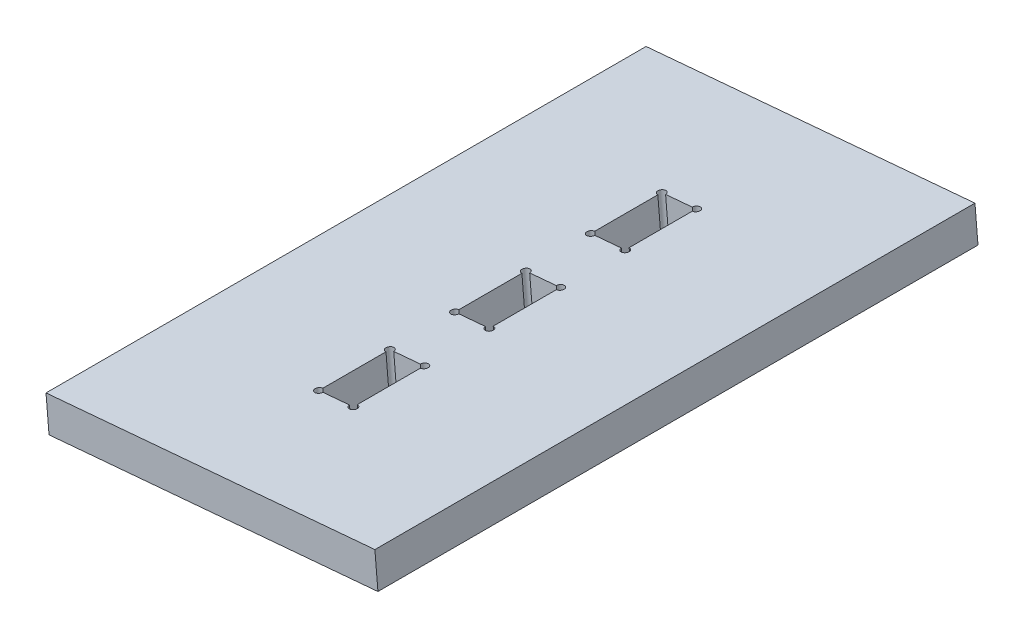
from build123d import *

# Parameters (mm, degrees)
SKETCH1_W           = 170
SKETCH1_H           = 309
BOSS_EXTRUDE1_DEPTH = 18
CUT_EXTRUDE1_REACH  = 344.447
SKETCH2_W           = 17.8
SKETCH2_H           = 36.5
LPATTERN1_COUNT     = 3
LPATTERN1_PITCH     = 70
CUT_EXTRUDE2_REACH  = 344.447
SKETCH3_R           = 2


with BuildPart() as part:
    # Sketch1 → Boss-Extrude1 (new body)
    with BuildSketch(Plane(origin=(-0.371692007, 4.248459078, 0), x_dir=(0.9961946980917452, 0.08715574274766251, 0), z_dir=(-0.08715574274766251, 0.9961946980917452, 0))):
        with Locations((147.447006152, 95.518357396)):
            Rectangle(SKETCH1_W, SKETCH1_H)
    extrude(amount=BOSS_EXTRUDE1_DEPTH)

    # Sketch2 → Cut-Extrude1 (cut, up to next)
    with BuildSketch(Plane(origin=(-1.940495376, 22.179963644, 0), x_dir=(0.9961946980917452, 0.08715574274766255, 0), z_dir=(-0.08715574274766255, 0.9961946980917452, 0)), mode=Mode.PRIVATE) as cut_extrude1_sk1:
        with Locations((147.447006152, 24.018357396)):
            Rectangle(SKETCH2_W, SKETCH2_H)
    cut_extrude1_tool1 = extrude(cut_extrude1_sk1.sketch, amount=-CUT_EXTRUDE1_REACH, mode=Mode.PRIVATE) & part.part
    cut_extrude1 = cut_extrude1_tool1.solids().sort_by_distance((144.94543, 35.030817, -24.018357))[0]
    add(cut_extrude1, mode=Mode.SUBTRACT)

    # LPattern1: Cut-Extrude1 ×3
    with Locations(*[(0, 0, -i * LPATTERN1_PITCH) for i in range(1, LPATTERN1_COUNT)]):
        add(cut_extrude1, mode=Mode.SUBTRACT)

    # Sketch3 → Cut-Extrude2 (cut, up to next)
    with BuildSketch(Plane(origin=(-1.940495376, 22.179963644, 0), x_dir=(0.9961946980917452, 0.08715574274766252, 0), z_dir=(-0.08715574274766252, 0.9961946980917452, 0)), mode=Mode.PRIVATE) as cut_extrude2_sk1:
        with Locations((156.347006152, 182.268357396)):
            Circle(SKETCH3_R)
    cut_extrude2_tool1 = extrude(cut_extrude2_sk1.sketch, amount=-CUT_EXTRUDE2_REACH, mode=Mode.PRIVATE) & part.part
    # Sketch3 → Cut-Extrude2 (cut, up to next)
    with BuildSketch(Plane(origin=(-1.940495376, 22.179963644, 0), x_dir=(0.9961946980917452, 0.08715574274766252, 0), z_dir=(-0.08715574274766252, 0.9961946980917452, 0)), mode=Mode.PRIVATE) as cut_extrude2_sk2:
        with Locations((138.547006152, 182.268357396)):
            Circle(SKETCH3_R)
    cut_extrude2_tool2 = extrude(cut_extrude2_sk2.sketch, amount=-CUT_EXTRUDE2_REACH, mode=Mode.PRIVATE) & part.part
    # Sketch3 → Cut-Extrude2 (cut, up to next)
    with BuildSketch(Plane(origin=(-1.940495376, 22.179963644, 0), x_dir=(0.9961946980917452, 0.08715574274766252, 0), z_dir=(-0.08715574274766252, 0.9961946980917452, 0)), mode=Mode.PRIVATE) as cut_extrude2_sk3:
        with Locations((138.547006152, 145.768357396)):
            Circle(SKETCH3_R)
    cut_extrude2_tool3 = extrude(cut_extrude2_sk3.sketch, amount=-CUT_EXTRUDE2_REACH, mode=Mode.PRIVATE) & part.part
    # Sketch3 → Cut-Extrude2 (cut, up to next)
    with BuildSketch(Plane(origin=(-1.940495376, 22.179963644, 0), x_dir=(0.9961946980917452, 0.08715574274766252, 0), z_dir=(-0.08715574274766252, 0.9961946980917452, 0)), mode=Mode.PRIVATE) as cut_extrude2_sk4:
        with Locations((156.347006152, 145.768357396)):
            Circle(SKETCH3_R)
    cut_extrude2_tool4 = extrude(cut_extrude2_sk4.sketch, amount=-CUT_EXTRUDE2_REACH, mode=Mode.PRIVATE) & part.part
    # Sketch3 → Cut-Extrude2 (cut, up to next)
    with BuildSketch(Plane(origin=(-1.940495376, 22.179963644, 0), x_dir=(0.9961946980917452, 0.08715574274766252, 0), z_dir=(-0.08715574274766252, 0.9961946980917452, 0)), mode=Mode.PRIVATE) as cut_extrude2_sk5:
        with Locations((156.347006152, 112.268357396)):
            Circle(SKETCH3_R)
    cut_extrude2_tool5 = extrude(cut_extrude2_sk5.sketch, amount=-CUT_EXTRUDE2_REACH, mode=Mode.PRIVATE) & part.part
    # Sketch3 → Cut-Extrude2 (cut, up to next)
    with BuildSketch(Plane(origin=(-1.940495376, 22.179963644, 0), x_dir=(0.9961946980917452, 0.08715574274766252, 0), z_dir=(-0.08715574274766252, 0.9961946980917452, 0)), mode=Mode.PRIVATE) as cut_extrude2_sk6:
        with Locations((138.547006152, 112.268357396)):
            Circle(SKETCH3_R)
    cut_extrude2_tool6 = extrude(cut_extrude2_sk6.sketch, amount=-CUT_EXTRUDE2_REACH, mode=Mode.PRIVATE) & part.part
    # Sketch3 → Cut-Extrude2 (cut, up to next)
    with BuildSketch(Plane(origin=(-1.940495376, 22.179963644, 0), x_dir=(0.9961946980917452, 0.08715574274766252, 0), z_dir=(-0.08715574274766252, 0.9961946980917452, 0)), mode=Mode.PRIVATE) as cut_extrude2_sk7:
        with Locations((138.547006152, 75.768357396)):
            Circle(SKETCH3_R)
    cut_extrude2_tool7 = extrude(cut_extrude2_sk7.sketch, amount=-CUT_EXTRUDE2_REACH, mode=Mode.PRIVATE) & part.part
    # Sketch3 → Cut-Extrude2 (cut, up to next)
    with BuildSketch(Plane(origin=(-1.940495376, 22.179963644, 0), x_dir=(0.9961946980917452, 0.08715574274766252, 0), z_dir=(-0.08715574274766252, 0.9961946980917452, 0)), mode=Mode.PRIVATE) as cut_extrude2_sk8:
        with Locations((156.347006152, 75.768357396)):
            Circle(SKETCH3_R)
    cut_extrude2_tool8 = extrude(cut_extrude2_sk8.sketch, amount=-CUT_EXTRUDE2_REACH, mode=Mode.PRIVATE) & part.part
    # Sketch3 → Cut-Extrude2 (cut, up to next)
    with BuildSketch(Plane(origin=(-1.940495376, 22.179963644, 0), x_dir=(0.9961946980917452, 0.08715574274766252, 0), z_dir=(-0.08715574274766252, 0.9961946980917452, 0)), mode=Mode.PRIVATE) as cut_extrude2_sk9:
        with Locations((156.347006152, 42.268357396)):
            Circle(SKETCH3_R)
    cut_extrude2_tool9 = extrude(cut_extrude2_sk9.sketch, amount=-CUT_EXTRUDE2_REACH, mode=Mode.PRIVATE) & part.part
    # Sketch3 → Cut-Extrude2 (cut, up to next)
    with BuildSketch(Plane(origin=(-1.940495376, 22.179963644, 0), x_dir=(0.9961946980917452, 0.08715574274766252, 0), z_dir=(-0.08715574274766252, 0.9961946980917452, 0)), mode=Mode.PRIVATE) as cut_extrude2_sk10:
        with Locations((138.547006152, 42.268357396)):
            Circle(SKETCH3_R)
    cut_extrude2_tool10 = extrude(cut_extrude2_sk10.sketch, amount=-CUT_EXTRUDE2_REACH, mode=Mode.PRIVATE) & part.part
    # Sketch3 → Cut-Extrude2 (cut, up to next)
    with BuildSketch(Plane(origin=(-1.940495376, 22.179963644, 0), x_dir=(0.9961946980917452, 0.08715574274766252, 0), z_dir=(-0.08715574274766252, 0.9961946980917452, 0)), mode=Mode.PRIVATE) as cut_extrude2_sk11:
        with Locations((138.547006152, 5.768357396)):
            Circle(SKETCH3_R)
    cut_extrude2_tool11 = extrude(cut_extrude2_sk11.sketch, amount=-CUT_EXTRUDE2_REACH, mode=Mode.PRIVATE) & part.part
    # Sketch3 → Cut-Extrude2 (cut, up to next)
    with BuildSketch(Plane(origin=(-1.940495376, 22.179963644, 0), x_dir=(0.9961946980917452, 0.08715574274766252, 0), z_dir=(-0.08715574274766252, 0.9961946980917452, 0)), mode=Mode.PRIVATE) as cut_extrude2_sk12:
        with Locations((156.347006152, 5.768357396)):
            Circle(SKETCH3_R)
    cut_extrude2_tool12 = extrude(cut_extrude2_sk12.sketch, amount=-CUT_EXTRUDE2_REACH, mode=Mode.PRIVATE) & part.part
    add(cut_extrude2_tool1.solids().sort_by_distance((153.811563, 35.806503, -182.268357))[0], mode=Mode.SUBTRACT)
    add(cut_extrude2_tool2.solids().sort_by_distance((136.079298, 34.255131, -182.268357))[0], mode=Mode.SUBTRACT)
    add(cut_extrude2_tool3.solids().sort_by_distance((136.079298, 34.255131, -145.768357))[0], mode=Mode.SUBTRACT)
    add(cut_extrude2_tool4.solids().sort_by_distance((153.811563, 35.806503, -145.768357))[0], mode=Mode.SUBTRACT)
    add(cut_extrude2_tool5.solids().sort_by_distance((153.811563, 35.806503, -112.268357))[0], mode=Mode.SUBTRACT)
    add(cut_extrude2_tool6.solids().sort_by_distance((136.079298, 34.255131, -112.268357))[0], mode=Mode.SUBTRACT)
    add(cut_extrude2_tool7.solids().sort_by_distance((136.079298, 34.255131, -75.768357))[0], mode=Mode.SUBTRACT)
    add(cut_extrude2_tool8.solids().sort_by_distance((153.811563, 35.806503, -75.768357))[0], mode=Mode.SUBTRACT)
    add(cut_extrude2_tool9.solids().sort_by_distance((153.811563, 35.806503, -42.268357))[0], mode=Mode.SUBTRACT)
    add(cut_extrude2_tool10.solids().sort_by_distance((136.079298, 34.255131, -42.268357))[0], mode=Mode.SUBTRACT)
    add(cut_extrude2_tool11.solids().sort_by_distance((136.079298, 34.255131, -5.768357))[0], mode=Mode.SUBTRACT)
    add(cut_extrude2_tool12.solids().sort_by_distance((153.811563, 35.806503, -5.768357))[0], mode=Mode.SUBTRACT)


solid = part.part
